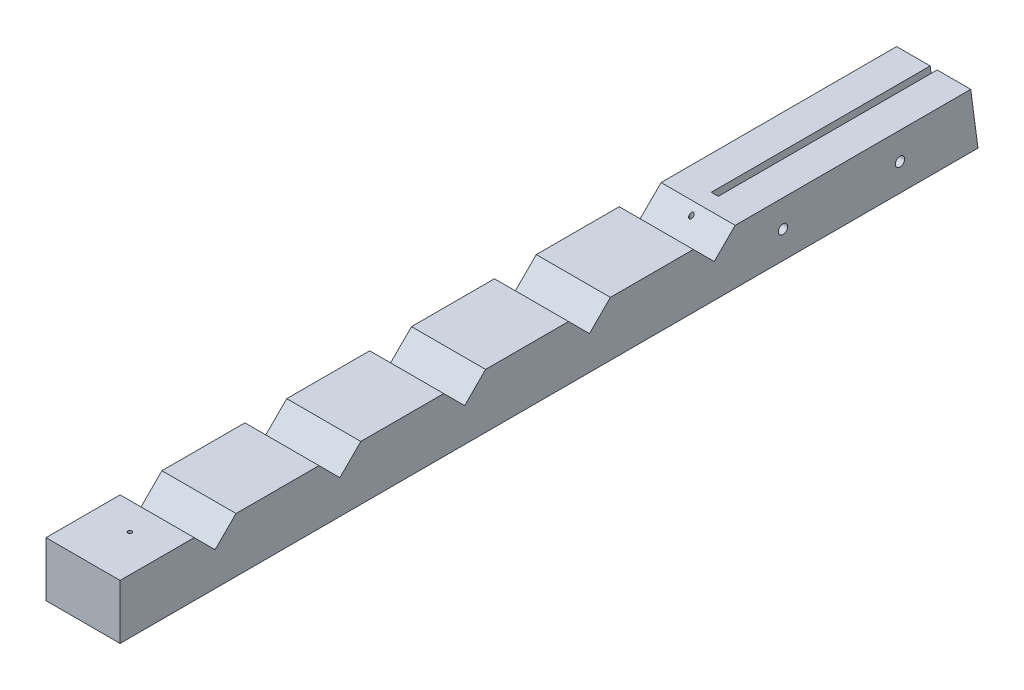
from build123d import *

# Parameters (mm, degrees)
SKETCH2_W                              = 95
SKETCH2_H                              = 70
EXTRUDE_H_JD_DEPTH                     = 1100
CUT_KVADRATISKT_REGELH_L_DEPTH         = 1104.576571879
LPATTERN_KVADRATISKA_REGELH_L_COUNT    = 5
LPATTERN_KVADRATISKA_REGELH_L_PITCH    = 160
CUT_SKRUVH_L_H_JDLED_REACH             = 1105.577
SKETCH6_R                              = 2.5
LPATTERN_SKRUVH_L_H_JDLED_COUNT        = 3
LPATTERN_SKRUVH_L_H_JDLED_PITCH        = 360
CUT_SKRUVH_L_F_R_STOLPF_STE_DEPTH      = 1104.576571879
CUT_SKRUVH_L_F_R_STOLPF_STE_DEPTH_BACK = 1104.576571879
SKETCH8_R                              = 6
SKETCH11_W                             = 9
SKETCH11_H                             = 150
CUT_SLITS_DEPTH                        = 290
CUT_NEDRE_STOLP_NDE_REACH              = 1105.577
CUT_NEDRE_STOLP_NDE_DIRECTION_2_REACH  = 1105.577


with BuildPart() as part:
    # Sketch2 → Extrude h_jd (new body)
    with BuildSketch(Plane.XY):
        with Locations((0, -40)):
            Rectangle(SKETCH2_W, SKETCH2_H)
    extrude(amount=EXTRUDE_H_JD_DEPTH)

    # Sketch5 → Cut kvadratiskt regelh_l (cut, symmetric)
    with BuildSketch(Plane(origin=(0, 0, 0), x_dir=(0, 0, -1), z_dir=(1, 0, 0))):
        Polygon((-978.180194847, -31.819805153), (-1010, 0), (-978.180194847, 31.819805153), (-946.360389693, 0), align=None)
    cut_kvadratiskt_regelh_l = extrude(amount=CUT_KVADRATISKT_REGELH_L_DEPTH, both=True, mode=Mode.SUBTRACT)

    # LPattern kvadratiska regelh_l: Cut kvadratiskt regelh_l ×5
    with Locations(*[(0, 0, -i * LPATTERN_KVADRATISKA_REGELH_L_PITCH) for i in range(1, LPATTERN_KVADRATISKA_REGELH_L_COUNT)]):
        add(cut_kvadratiskt_regelh_l, mode=Mode.SUBTRACT)

    # Sketch6 → Cut skruvh_l h_jdled (cut, up to next)
    with BuildSketch(Plane(origin=(0, 0, 0), x_dir=(1, 0, 0), z_dir=(0, 1, 0)), mode=Mode.PRIVATE) as cut_skruvh_l_h_jdled_sk1:
        with Locations(Location((0, -1040, 0), (0, 0, 180))):
            Circle(SKETCH6_R)
    cut_skruvh_l_h_jdled_tool1 = extrude(cut_skruvh_l_h_jdled_sk1.sketch, amount=-CUT_SKRUVH_L_H_JDLED_REACH, mode=Mode.PRIVATE) & part.part
    cut_skruvh_l_h_jdled = cut_skruvh_l_h_jdled_tool1.solids().sort_by_distance((0, 0, 1040))[0]
    add(cut_skruvh_l_h_jdled, mode=Mode.SUBTRACT)

    # LPattern skruvh_l h_jdled: Cut skruvh_l h_jdled ×3
    with Locations(*[(0, 0, -i * LPATTERN_SKRUVH_L_H_JDLED_PITCH) for i in range(1, LPATTERN_SKRUVH_L_H_JDLED_COUNT)]):
        add(cut_skruvh_l_h_jdled, mode=Mode.SUBTRACT)

    # Sketch8 → Cut skruvh_l f_r stolpf_ste (cut, two sides: drawn at the far end of the back side and taken through both)
    with BuildSketch(Plane.YZ.offset(-CUT_SKRUVH_L_F_R_STOLPF_STE_DEPTH_BACK)):
        with Locations((40, 250)):
            Circle(SKETCH8_R)
        with Locations((40, 100)):
            Circle(SKETCH8_R)
        with Locations(Location((-40, 100, 0), (0, 0, 270))):
            Circle(SKETCH8_R)
        with Locations(Location((-40, 250, 0), (0, 0, 270))):
            Circle(SKETCH8_R)
    extrude(amount=CUT_SKRUVH_L_F_R_STOLPF_STE_DEPTH + CUT_SKRUVH_L_F_R_STOLPF_STE_DEPTH_BACK, mode=Mode.SUBTRACT)

    # Sketch11 → Cut slits (cut)
    with BuildSketch(Plane.XY):
        Rectangle(SKETCH11_W, SKETCH11_H)
    extrude(amount=CUT_SLITS_DEPTH, mode=Mode.SUBTRACT)

    # Sketch10 → Cut nedre stolp_nde (cut, up to next)
    with BuildSketch(Plane.ZY, mode=Mode.PRIVATE) as cut_nedre_stolp_nde_sk1:
        Polygon((-294.772718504, 2285.795388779), (0, 75), (10, 0), (0, -75), (-294.772718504, -2285.795388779), (-4755.493380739, -2285.795388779), (-4755.493380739, 2285.795388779), align=None)
    cut_nedre_stolp_nde_tool1 = extrude(cut_nedre_stolp_nde_sk1.sketch, amount=CUT_NEDRE_STOLP_NDE_REACH, mode=Mode.PRIVATE) & part.part
    add(cut_nedre_stolp_nde_tool1.solids().sort_by_distance((0, 0, -2448.100898))[0], mode=Mode.SUBTRACT)

    # Sketch10 → Cut nedre stolp_nde direction 2 (cut, up to next)
    with BuildSketch(Plane.ZY, mode=Mode.PRIVATE) as cut_nedre_stolp_nde_direction_2_sk1:
        Polygon((-294.772718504, 2285.795388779), (0, 75), (10, 0), (0, -75), (-294.772718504, -2285.795388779), (-4755.493380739, -2285.795388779), (-4755.493380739, 2285.795388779), align=None)
    cut_nedre_stolp_nde_direction_2_tool1 = extrude(cut_nedre_stolp_nde_direction_2_sk1.sketch, amount=-CUT_NEDRE_STOLP_NDE_DIRECTION_2_REACH, mode=Mode.PRIVATE) & part.part
    add(cut_nedre_stolp_nde_direction_2_tool1.solids().sort_by_distance((0, 0, -2448.100898))[0], mode=Mode.SUBTRACT)


solid = part.part
